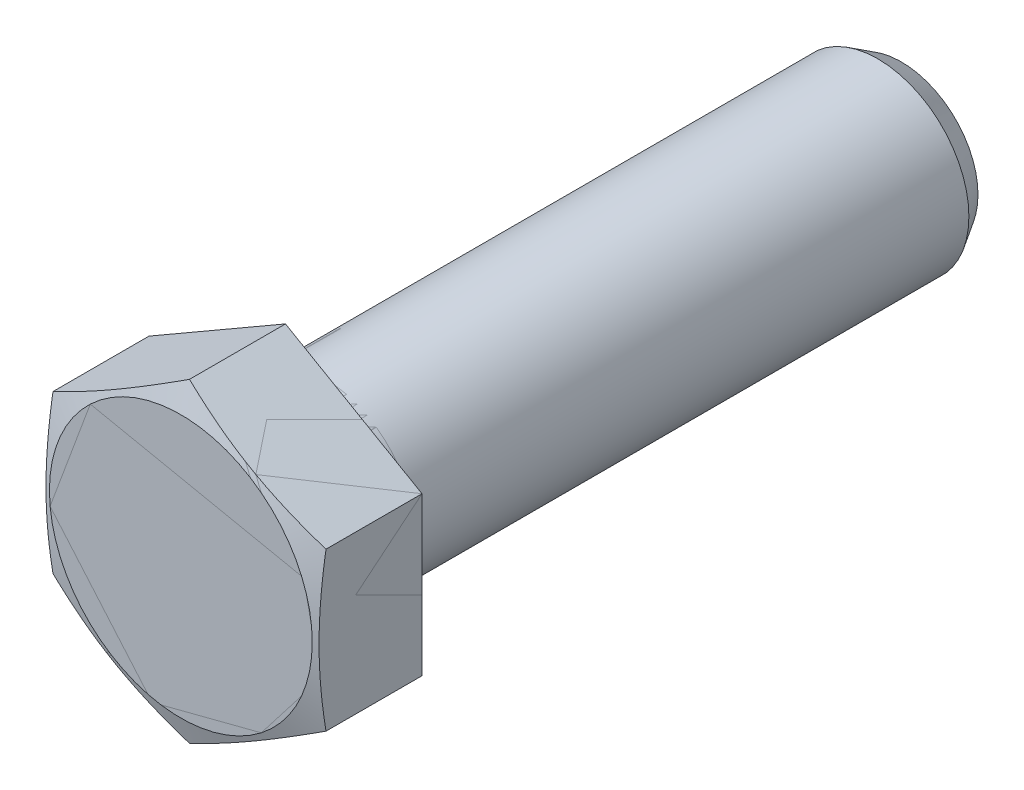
ISO-10303-21;
HEADER;
FILE_DESCRIPTION(('STEP AP214'),'2;1');
FILE_NAME('part.step','',(''),(''),'','','');
FILE_SCHEMA(('AUTOMOTIVE_DESIGN { 1 0 10303 214 1 1 1 1 }'));
ENDSEC;
DATA;
#1=APPLICATION_CONTEXT('core data for automotive mechanical design processes');
#2=APPLICATION_PROTOCOL_DEFINITION('international standard','automotive_design',2000,#1);
#3=PRODUCT_CONTEXT('',#1,'mechanical');
#4=PRODUCT('Part','Part','',(#3));
#5=PRODUCT_RELATED_PRODUCT_CATEGORY('part','',(#4));
#6=PRODUCT_DEFINITION_FORMATION('','',#4);
#7=PRODUCT_DEFINITION_CONTEXT('part definition',#1,'design');
#8=PRODUCT_DEFINITION('design','',#6,#7);
#9=PRODUCT_DEFINITION_SHAPE('','',#8);
#10=(LENGTH_UNIT() NAMED_UNIT(*) SI_UNIT(.MILLI.,.METRE.));
#11=(NAMED_UNIT(*) PLANE_ANGLE_UNIT() SI_UNIT($,.RADIAN.));
#12=(NAMED_UNIT(*) SI_UNIT($,.STERADIAN.) SOLID_ANGLE_UNIT());
#13=UNCERTAINTY_MEASURE_WITH_UNIT(LENGTH_MEASURE(1.E-05),#10,'distance_accuracy_value','');
#14=(GEOMETRIC_REPRESENTATION_CONTEXT(3) GLOBAL_UNCERTAINTY_ASSIGNED_CONTEXT((#13)) GLOBAL_UNIT_ASSIGNED_CONTEXT((#10,
#11,#12)) REPRESENTATION_CONTEXT('',''));
#15=CARTESIAN_POINT('',(0.,0.,0.));
#16=DIRECTION('',(0.,0.,1.));
#17=DIRECTION('',(1.,0.,0.));
#18=AXIS2_PLACEMENT_3D('',#15,#16,#17);
#19=CARTESIAN_POINT('',(0.,0.,0.6));
#20=DIRECTION('',(0.,0.,1.));
#21=DIRECTION('',(1.,0.,0.));
#22=AXIS2_PLACEMENT_3D('',#19,#20,#21);
#23=TOROIDAL_SURFACE('',#22,7.6,0.6);
#24=CARTESIAN_POINT('',(0.,0.,0.6));
#25=DIRECTION('',(0.,0.,1.));
#26=DIRECTION('',(1.,0.,0.));
#27=AXIS2_PLACEMENT_3D('',#24,#25,#26);
#28=CIRCLE('',#27,8.2);
#29=CARTESIAN_POINT('',(8.2,0.,0.600000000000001));
#30=VERTEX_POINT('',#29);
#31=EDGE_CURVE('P0_E11',#30,#30,#28,.T.);
#32=ORIENTED_EDGE('',*,*,#31,.F.);
#33=EDGE_LOOP('',(#32));
#34=FACE_BOUND('',#33,.T.);
#35=CARTESIAN_POINT('',(0.,0.,0.));
#36=DIRECTION('',(0.,0.,1.));
#37=DIRECTION('',(1.,0.,0.));
#38=AXIS2_PLACEMENT_3D('',#35,#36,#37);
#39=CIRCLE('',#38,7.6);
#40=CARTESIAN_POINT('',(7.6,0.,0.));
#41=VERTEX_POINT('',#40);
#42=EDGE_CURVE('P0_E33',#41,#41,#39,.T.);
#43=ORIENTED_EDGE('',*,*,#42,.T.);
#44=EDGE_LOOP('',(#43));
#45=FACE_BOUND('',#44,.T.);
#46=ADVANCED_FACE('P0_F26',(#34,#45),#23,.T.);
#47=CARTESIAN_POINT('',(0.,7.6,0.));
#48=DIRECTION('',(0.,0.,-1.));
#49=DIRECTION('',(-1.,0.,0.));
#50=AXIS2_PLACEMENT_3D('',#47,#48,#49);
#51=PLANE('',#50);
#52=CARTESIAN_POINT('',(0.,0.,0.));
#53=DIRECTION('',(0.,0.,1.));
#54=DIRECTION('',(1.,0.,0.));
#55=AXIS2_PLACEMENT_3D('',#52,#53,#54);
#56=CIRCLE('',#55,6.6);
#57=CARTESIAN_POINT('',(6.6,0.,0.));
#58=VERTEX_POINT('',#57);
#59=EDGE_CURVE('P0_E118',#58,#58,#56,.T.);
#60=ORIENTED_EDGE('',*,*,#59,.T.);
#61=EDGE_LOOP('',(#60));
#62=FACE_BOUND('',#61,.T.);
#63=ORIENTED_EDGE('',*,*,#42,.F.);
#64=EDGE_LOOP('',(#63));
#65=FACE_BOUND('',#64,.T.);
#66=ADVANCED_FACE('P0_F124',(#62,#65),#51,.T.);
#67=CARTESIAN_POINT('',(0.,0.,-0.6));
#68=DIRECTION('',(0.,0.,1.));
#69=DIRECTION('',(1.,0.,0.));
#70=AXIS2_PLACEMENT_3D('',#67,#68,#69);
#71=TOROIDAL_SURFACE('',#70,6.6,0.6);
#72=CARTESIAN_POINT('',(0.,0.,-0.6));
#73=DIRECTION('',(0.,0.,1.));
#74=DIRECTION('',(1.,0.,0.));
#75=AXIS2_PLACEMENT_3D('',#72,#73,#74);
#76=CIRCLE('',#75,6.);
#77=CARTESIAN_POINT('',(6.,0.,-0.6));
#78=VERTEX_POINT('',#77);
#79=EDGE_CURVE('P0_E115',#78,#78,#76,.T.);
#80=ORIENTED_EDGE('',*,*,#79,.T.);
#81=EDGE_LOOP('',(#80));
#82=FACE_BOUND('',#81,.T.);
#83=ORIENTED_EDGE('',*,*,#59,.F.);
#84=EDGE_LOOP('',(#83));
#85=FACE_BOUND('',#84,.T.);
#86=ADVANCED_FACE('P0_F126',(#82,#85),#71,.F.);
#87=CARTESIAN_POINT('',(-9.,-5.19615,0.6));
#88=DIRECTION('',(0.,0.,-1.));
#89=DIRECTION('',(-1.,0.,0.));
#90=AXIS2_PLACEMENT_3D('',#87,#88,#89);
#91=PLANE('',#90);
#92=DIRECTION('',(0.,-1.,0.));
#93=VECTOR('',#92,1.);
#94=CARTESIAN_POINT('',(-9.,5.19615,0.6));
#95=LINE('',#94,#93);
#96=CARTESIAN_POINT('',(-9.,5.19615,0.6));
#97=VERTEX_POINT('',#96);
#98=CARTESIAN_POINT('',(-9.,-5.19615,0.6));
#99=VERTEX_POINT('',#98);
#100=EDGE_CURVE('P0_E92',#97,#99,#95,.T.);
#101=ORIENTED_EDGE('',*,*,#100,.F.);
#102=DIRECTION('',(0.866025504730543,0.499999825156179,0.));
#103=VECTOR('',#102,1.);
#104=CARTESIAN_POINT('',(-9.,5.19615,0.6));
#105=LINE('',#104,#103);
#106=CARTESIAN_POINT('',(0.,10.3923,0.6));
#107=VERTEX_POINT('',#106);
#108=EDGE_CURVE('P0_E97',#97,#107,#105,.T.);
#109=ORIENTED_EDGE('',*,*,#108,.T.);
#110=DIRECTION('',(0.866025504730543,-0.499999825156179,0.));
#111=VECTOR('',#110,1.);
#112=CARTESIAN_POINT('',(0.,10.3923,0.6));
#113=LINE('',#112,#111);
#114=CARTESIAN_POINT('',(9.,5.19615,0.6));
#115=VERTEX_POINT('',#114);
#116=EDGE_CURVE('P0_E103',#107,#115,#113,.T.);
#117=ORIENTED_EDGE('',*,*,#116,.T.);
#118=DIRECTION('',(0.,-1.,0.));
#119=VECTOR('',#118,1.);
#120=CARTESIAN_POINT('',(9.,5.19615,0.6));
#121=LINE('',#120,#119);
#122=CARTESIAN_POINT('',(9.,-5.19615,0.6));
#123=VERTEX_POINT('',#122);
#124=EDGE_CURVE('P0_E233',#115,#123,#121,.T.);
#125=ORIENTED_EDGE('',*,*,#124,.T.);
#126=DIRECTION('',(-0.866025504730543,-0.499999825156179,0.));
#127=VECTOR('',#126,1.);
#128=CARTESIAN_POINT('',(9.,-5.19615,0.6));
#129=LINE('',#128,#127);
#130=CARTESIAN_POINT('',(0.,-10.3923,0.6));
#131=VERTEX_POINT('',#130);
#132=EDGE_CURVE('P0_E219',#123,#131,#129,.T.);
#133=ORIENTED_EDGE('',*,*,#132,.T.);
#134=DIRECTION('',(-0.866025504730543,0.499999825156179,0.));
#135=VECTOR('',#134,1.);
#136=CARTESIAN_POINT('',(0.,-10.3923,0.6));
#137=LINE('',#136,#135);
#138=EDGE_CURVE('P0_E217',#131,#99,#137,.T.);
#139=ORIENTED_EDGE('',*,*,#138,.T.);
#140=EDGE_LOOP('',(#101,#109,#117,#125,#133,#139));
#141=FACE_BOUND('',#140,.T.);
#142=ORIENTED_EDGE('',*,*,#31,.T.);
#143=EDGE_LOOP('',(#142));
#144=FACE_BOUND('',#143,.T.);
#145=ADVANCED_FACE('P0_F132',(#141,#144),#91,.T.);
#146=CARTESIAN_POINT('',(-9.,5.19615,0.6));
#147=DIRECTION('',(-1.,0.,0.));
#148=DIRECTION('',(0.,0.,1.));
#149=AXIS2_PLACEMENT_3D('',#146,#147,#148);
#150=PLANE('',#149);
#151=CARTESIAN_POINT('',(-9.,-13.7470885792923,4.93453459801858));
#152=CARTESIAN_POINT('',(-9.,-13.3392874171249,5.04718491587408));
#153=CARTESIAN_POINT('',(-9.,-12.9311091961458,5.15849505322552));
#154=CARTESIAN_POINT('',(-9.,-12.1138094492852,5.37769955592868));
#155=CARTESIAN_POINT('',(-9.,-11.7046878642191,5.48559370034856));
#156=CARTESIAN_POINT('',(-9.,-10.8847498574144,5.69737490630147));
#157=CARTESIAN_POINT('',(-9.,-10.4739318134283,5.80125570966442));
#158=CARTESIAN_POINT('',(-9.,-9.65101983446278,6.00383051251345));
#159=CARTESIAN_POINT('',(-9.,-9.23892591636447,6.10252458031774));
#160=CARTESIAN_POINT('',(-9.,-8.41811436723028,6.29233104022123));
#161=CARTESIAN_POINT('',(-9.,-8.0094143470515,6.38351921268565));
#162=CARTESIAN_POINT('',(-9.,-7.19032773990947,6.55804869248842));
#163=CARTESIAN_POINT('',(-9.,-6.77994114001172,6.64138993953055));
#164=CARTESIAN_POINT('',(-9.,-5.95738209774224,6.79830951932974));
#165=CARTESIAN_POINT('',(-9.,-5.54521006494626,6.8718899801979));
#166=CARTESIAN_POINT('',(-9.,-4.71888494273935,7.00707177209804));
#167=CARTESIAN_POINT('',(-9.,-4.30473186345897,7.0686731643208));
#168=CARTESIAN_POINT('',(-9.,-3.48183307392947,7.17648586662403));
#169=CARTESIAN_POINT('',(-9.,-3.07312089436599,7.22294955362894));
#170=CARTESIAN_POINT('',(-9.,-2.2541675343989,7.29970130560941));
#171=CARTESIAN_POINT('',(-9.,-1.84392640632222,7.32998991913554));
#172=CARTESIAN_POINT('',(-9.,-1.0227798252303,7.37263456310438));
#173=CARTESIAN_POINT('',(-9.,-0.611875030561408,7.38500302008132));
#174=CARTESIAN_POINT('',(-9.,0.210073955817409,7.39106039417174));
#175=CARTESIAN_POINT('',(-9.,0.621118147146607,7.38474936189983));
#176=CARTESIAN_POINT('',(-9.,1.44463812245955,7.35377442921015));
#177=CARTESIAN_POINT('',(-9.,1.85711025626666,7.32901539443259));
#178=CARTESIAN_POINT('',(-9.,2.68067263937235,7.26253252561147));
#179=CARTESIAN_POINT('',(-9.,3.09176284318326,7.22080813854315));
#180=CARTESIAN_POINT('',(-9.,3.91254232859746,7.12251563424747));
#181=CARTESIAN_POINT('',(-9.,4.32222985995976,7.0659331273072));
#182=CARTESIAN_POINT('',(-9.,5.13967057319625,6.94032062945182));
#183=CARTESIAN_POINT('',(-9.,5.54742374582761,6.87129057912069));
#184=CARTESIAN_POINT('',(-9.,6.34392226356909,6.72614777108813));
#185=CARTESIAN_POINT('',(-9.,6.73274502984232,6.65045563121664));
#186=CARTESIAN_POINT('',(-9.,7.50883064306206,6.49141952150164));
#187=CARTESIAN_POINT('',(-9.,7.89609341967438,6.40807521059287));
#188=CARTESIAN_POINT('',(-9.,8.66928474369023,6.2351536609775));
#189=CARTESIAN_POINT('',(-9.,9.05521306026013,6.14557539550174));
#190=CARTESIAN_POINT('',(-9.,9.82584964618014,5.96135982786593));
#191=CARTESIAN_POINT('',(-9.,10.2105579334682,5.86672260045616));
#192=CARTESIAN_POINT('',(-9.,10.9791002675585,5.67327627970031));
#193=CARTESIAN_POINT('',(-9.,11.3629338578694,5.57446537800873));
#194=CARTESIAN_POINT('',(-9.,12.1297113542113,5.37344471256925));
#195=CARTESIAN_POINT('',(-9.,12.5126552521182,5.27123491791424));
#196=CARTESIAN_POINT('',(-9.,13.6602702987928,4.96044653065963));
#197=CARTESIAN_POINT('',(-9.,14.4238088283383,4.74768748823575));
#198=CARTESIAN_POINT('',(-9.,15.9383314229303,4.31737090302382));
#199=CARTESIAN_POINT('',(-9.,16.689345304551,4.09991758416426));
#200=CARTESIAN_POINT('',(-9.,18.189792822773,3.65955502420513));
#201=CARTESIAN_POINT('',(-9.,18.9392264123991,3.43664562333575));
#202=CARTESIAN_POINT('',(-9.,20.4353823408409,2.98724599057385));
#203=CARTESIAN_POINT('',(-9.,21.1821071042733,2.76076381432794));
#204=CARTESIAN_POINT('',(-9.,22.3014752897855,2.41875920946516));
#205=CARTESIAN_POINT('',(-9.,22.674468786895,2.30438036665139));
#206=CARTESIAN_POINT('',(-9.,23.4202477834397,2.07494863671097));
#207=CARTESIAN_POINT('',(-9.,23.7930332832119,1.95989575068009));
#208=CARTESIAN_POINT('',(-9.,24.1657280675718,1.84454977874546));
#209=B_SPLINE_CURVE_WITH_KNOTS('',3,(#151,#152,#153,#154,#155,#156,#157,#158,#159,#160,#161,
#162,#163,#164,#165,#166,#167,#168,#169,#170,#171,#172,#173,#174,#175,#176,#177,#178,#179,#180,
#181,#182,#183,#184,#185,#186,#187,#188,#189,#190,#191,#192,#193,#194,#195,#196,#197,#198,#199,
#200,#201,#202,#203,#204,#205,#206,#207,#208),.UNSPECIFIED.,.F.,.F.,(4,2,2,2,2,2,2,2,2,2,2,2,2,
2,2,2,2,2,2,2,2,2,2,2,2,2,2,2,4),(0.,1.26923056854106,2.53854305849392,3.80976091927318,
5.08096203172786,6.33714874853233,7.59334511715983,8.84926714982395,10.1051827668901,
11.3389379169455,12.5726512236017,13.8055086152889,15.0383626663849,16.2776188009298,
17.5169153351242,18.7574165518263,19.9979236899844,21.1861971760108,22.3745236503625,
23.5630463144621,24.7515514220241,25.9405768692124,27.1296131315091,29.5074255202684,
31.8529867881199,34.1986168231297,36.5395543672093,37.7099640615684,38.8803718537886),.UNSPECIFIED.);
#210=CARTESIAN_POINT('',(-9.,5.19615,6.92894463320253));
#211=VERTEX_POINT('',#210);
#212=CARTESIAN_POINT('',(-9.,-5.19615,6.92894463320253));
#213=VERTEX_POINT('',#212);
#214=EDGE_CURVE('P0_E81',#211,#213,#209,.F.);
#215=ORIENTED_EDGE('',*,*,#214,.F.);
#216=DIRECTION('',(0.,0.,1.));
#217=VECTOR('',#216,1.);
#218=CARTESIAN_POINT('',(-9.,5.19615,0.6));
#219=LINE('',#218,#217);
#220=EDGE_CURVE('P0_E90',#97,#211,#219,.T.);
#221=ORIENTED_EDGE('',*,*,#220,.F.);
#222=ORIENTED_EDGE('',*,*,#100,.T.);
#223=DIRECTION('',(0.,0.,1.));
#224=VECTOR('',#223,1.);
#225=CARTESIAN_POINT('',(-9.,-5.19615,0.6));
#226=LINE('',#225,#224);
#227=EDGE_CURVE('P0_E48',#99,#213,#226,.T.);
#228=ORIENTED_EDGE('',*,*,#227,.T.);
#229=EDGE_LOOP('',(#215,#221,#222,#228));
#230=FACE_BOUND('',#229,.T.);
#231=ADVANCED_FACE('P0_F88',(#230),#150,.T.);
#232=CARTESIAN_POINT('',(0.,-10.3923,0.6));
#233=DIRECTION('',(0.499999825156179,0.866025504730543,0.));
#234=DIRECTION('',(0.866025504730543,-0.499999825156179,0.));
#235=AXIS2_PLACEMENT_3D('',#232,#233,#234);
#236=PLANE('',#235);
#237=DIRECTION('',(0.,0.,1.));
#238=VECTOR('',#237,1.);
#239=CARTESIAN_POINT('',(0.,-10.3923,0.6));
#240=LINE('',#239,#238);
#241=CARTESIAN_POINT('',(0.,-10.3923,6.92894583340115));
#242=VERTEX_POINT('',#241);
#243=EDGE_CURVE('P0_E224',#131,#242,#240,.T.);
#244=ORIENTED_EDGE('',*,*,#243,.T.);
#245=CARTESIAN_POINT('',(1.9999999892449E-07,-10.39230011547,6.92894579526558));
#246=CARTESIAN_POINT('',(-0.373107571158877,-10.1768863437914,7.00011400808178));
#247=CARTESIAN_POINT('',(-0.747233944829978,-9.96088448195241,7.06480339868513));
#248=CARTESIAN_POINT('',(-1.49749109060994,-9.52772351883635,7.17855326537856));
#249=CARTESIAN_POINT('',(-1.87362298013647,-9.31056377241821,7.22760383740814));
#250=CARTESIAN_POINT('',(-2.62444400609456,-8.87707725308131,7.30699688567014));
#251=CARTESIAN_POINT('',(-2.99912148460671,-8.66075721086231,7.33748241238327));
#252=CARTESIAN_POINT('',(-3.74919949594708,-8.22769967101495,7.37836755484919));
#253=CARTESIAN_POINT('',(-4.1245997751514,-8.01096231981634,7.38877325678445));
#254=CARTESIAN_POINT('',(-4.87540032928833,-7.57748761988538,7.38877313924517));
#255=CARTESIAN_POINT('',(-5.25080060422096,-7.36075027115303,7.37836731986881));
#256=CARTESIAN_POINT('',(-6.00087860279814,-6.9276927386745,7.33748195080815));
#257=CARTESIAN_POINT('',(-6.37555607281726,-6.71137270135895,7.30699631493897));
#258=CARTESIAN_POINT('',(-7.12637707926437,-6.27788619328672,7.22760306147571));
#259=CARTESIAN_POINT('',(-7.50250895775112,-6.06072645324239,7.17855239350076));
#260=CARTESIAN_POINT('',(-8.25276607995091,-5.62756550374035,7.06480235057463));
#261=CARTESIAN_POINT('',(-8.62689244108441,-5.41156364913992,7.00011287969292));
#262=CARTESIAN_POINT('',(-9.0000002,-5.19614988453,6.92894459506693));
#263=B_SPLINE_CURVE_WITH_KNOTS('',3,(#245,#246,#247,#248,#249,#250,#251,#252,#253,#254,#255,
#256,#257,#258,#259,#260,#261,#262),.UNSPECIFIED.,.F.,.F.,(4,2,2,2,2,2,2,2,4),(0.,
1.31010734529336,2.62104274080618,3.9217446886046,5.22205233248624,6.52235997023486,
7.82306191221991,9.13399730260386,10.4441046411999),.UNSPECIFIED.);
#264=EDGE_CURVE('P0_E93',#242,#213,#263,.T.);
#265=ORIENTED_EDGE('',*,*,#264,.T.);
#266=ORIENTED_EDGE('',*,*,#227,.F.);
#267=ORIENTED_EDGE('',*,*,#138,.F.);
#268=EDGE_LOOP('',(#244,#265,#266,#267));
#269=FACE_BOUND('',#268,.T.);
#270=ADVANCED_FACE('P0_F153',(#269),#236,.F.);
#271=CARTESIAN_POINT('',(9.,-5.19615,0.6));
#272=DIRECTION('',(-0.499999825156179,0.866025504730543,0.));
#273=DIRECTION('',(0.866025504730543,0.499999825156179,0.));
#274=AXIS2_PLACEMENT_3D('',#271,#272,#273);
#275=PLANE('',#274);
#276=DIRECTION('',(0.,0.,1.));
#277=VECTOR('',#276,1.);
#278=CARTESIAN_POINT('',(9.,-5.19615,0.6));
#279=LINE('',#278,#277);
#280=CARTESIAN_POINT('',(9.,-5.19615,6.92894463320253));
#281=VERTEX_POINT('',#280);
#282=EDGE_CURVE('P0_E227',#123,#281,#279,.T.);
#283=ORIENTED_EDGE('',*,*,#282,.T.);
#284=CARTESIAN_POINT('',(9.0000002,-5.19614988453,6.92894459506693));
#285=CARTESIAN_POINT('',(8.62689244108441,-5.41156364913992,7.00011287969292));
#286=CARTESIAN_POINT('',(8.25276607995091,-5.62756550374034,7.06480235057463));
#287=CARTESIAN_POINT('',(7.50250895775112,-6.06072645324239,7.17855239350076));
#288=CARTESIAN_POINT('',(7.12637707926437,-6.27788619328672,7.22760306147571));
#289=CARTESIAN_POINT('',(6.37555607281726,-6.71137270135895,7.30699631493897));
#290=CARTESIAN_POINT('',(6.00087860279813,-6.9276927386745,7.33748195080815));
#291=CARTESIAN_POINT('',(5.25080060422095,-7.36075027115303,7.37836731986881));
#292=CARTESIAN_POINT('',(4.87540032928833,-7.57748761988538,7.38877313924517));
#293=CARTESIAN_POINT('',(4.12459977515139,-8.01096231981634,7.38877325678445));
#294=CARTESIAN_POINT('',(3.74919949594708,-8.22769967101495,7.3783675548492));
#295=CARTESIAN_POINT('',(2.99912148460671,-8.66075721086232,7.33748241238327));
#296=CARTESIAN_POINT('',(2.62444400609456,-8.87707725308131,7.30699688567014));
#297=CARTESIAN_POINT('',(1.87362298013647,-9.31056377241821,7.22760383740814));
#298=CARTESIAN_POINT('',(1.49749109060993,-9.52772351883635,7.17855326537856));
#299=CARTESIAN_POINT('',(0.747233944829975,-9.96088448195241,7.06480339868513));
#300=CARTESIAN_POINT('',(0.373107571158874,-10.1768863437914,7.00011400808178));
#301=CARTESIAN_POINT('',(-2.00000003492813E-07,-10.39230011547,6.92894579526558));
#302=B_SPLINE_CURVE_WITH_KNOTS('',3,(#284,#285,#286,#287,#288,#289,#290,#291,#292,#293,#294,
#295,#296,#297,#298,#299,#300,#301),.UNSPECIFIED.,.F.,.F.,(4,2,2,2,2,2,2,2,4),(0.,
1.31010733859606,2.62104272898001,3.92174467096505,5.22205230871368,6.52235995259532,
7.82306190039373,9.13399729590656,10.4441046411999),.UNSPECIFIED.);
#303=EDGE_CURVE('P0_E190',#281,#242,#302,.T.);
#304=ORIENTED_EDGE('',*,*,#303,.T.);
#305=ORIENTED_EDGE('',*,*,#243,.F.);
#306=ORIENTED_EDGE('',*,*,#132,.F.);
#307=EDGE_LOOP('',(#283,#304,#305,#306));
#308=FACE_BOUND('',#307,.T.);
#309=ADVANCED_FACE('P0_F195',(#308),#275,.F.);
#310=CARTESIAN_POINT('',(9.,5.19615,0.6));
#311=DIRECTION('',(-1.,0.,0.));
#312=DIRECTION('',(0.,0.,1.));
#313=AXIS2_PLACEMENT_3D('',#310,#311,#312);
#314=PLANE('',#313);
#315=DIRECTION('',(0.,0.,1.));
#316=VECTOR('',#315,1.);
#317=CARTESIAN_POINT('',(9.,5.19615,0.6));
#318=LINE('',#317,#316);
#319=CARTESIAN_POINT('',(9.,5.19615,6.92894463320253));
#320=VERTEX_POINT('',#319);
#321=EDGE_CURVE('P0_E101',#115,#320,#318,.T.);
#322=ORIENTED_EDGE('',*,*,#321,.T.);
#323=CARTESIAN_POINT('',(9.,-13.7470885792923,4.93453459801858));
#324=CARTESIAN_POINT('',(9.,-13.3392874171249,5.04718491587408));
#325=CARTESIAN_POINT('',(9.,-12.9311091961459,5.15849505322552));
#326=CARTESIAN_POINT('',(9.,-12.1138094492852,5.37769955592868));
#327=CARTESIAN_POINT('',(9.,-11.7046878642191,5.48559370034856));
#328=CARTESIAN_POINT('',(9.,-10.8847498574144,5.69737490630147));
#329=CARTESIAN_POINT('',(9.,-10.4739318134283,5.80125570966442));
#330=CARTESIAN_POINT('',(9.,-9.65101983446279,6.00383051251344));
#331=CARTESIAN_POINT('',(9.,-9.23892591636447,6.10252458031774));
#332=CARTESIAN_POINT('',(9.,-8.41811436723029,6.29233104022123));
#333=CARTESIAN_POINT('',(9.,-8.00941434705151,6.38351921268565));
#334=CARTESIAN_POINT('',(9.,-7.19032773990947,6.55804869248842));
#335=CARTESIAN_POINT('',(9.,-6.77994114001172,6.64138993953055));
#336=CARTESIAN_POINT('',(9.,-5.95738209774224,6.79830951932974));
#337=CARTESIAN_POINT('',(9.,-5.54521006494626,6.8718899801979));
#338=CARTESIAN_POINT('',(9.,-4.71888494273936,7.00707177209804));
#339=CARTESIAN_POINT('',(9.,-4.30473186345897,7.0686731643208));
#340=CARTESIAN_POINT('',(9.,-3.48183307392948,7.17648586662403));
#341=CARTESIAN_POINT('',(9.,-3.073120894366,7.22294955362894));
#342=CARTESIAN_POINT('',(9.,-2.25416753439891,7.29970130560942));
#343=CARTESIAN_POINT('',(9.,-1.84392640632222,7.32998991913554));
#344=CARTESIAN_POINT('',(9.,-1.0227798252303,7.37263456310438));
#345=CARTESIAN_POINT('',(9.,-0.611875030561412,7.38500302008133));
#346=CARTESIAN_POINT('',(9.,0.210073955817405,7.39106039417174));
#347=CARTESIAN_POINT('',(9.,0.621118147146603,7.38474936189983));
#348=CARTESIAN_POINT('',(9.,1.44463812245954,7.35377442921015));
#349=CARTESIAN_POINT('',(9.,1.85711025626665,7.32901539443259));
#350=CARTESIAN_POINT('',(9.,2.68067263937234,7.26253252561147));
#351=CARTESIAN_POINT('',(9.,3.09176284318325,7.22080813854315));
#352=CARTESIAN_POINT('',(9.,3.91254232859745,7.12251563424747));
#353=CARTESIAN_POINT('',(9.,4.32222985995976,7.06593312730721));
#354=CARTESIAN_POINT('',(9.,5.13967057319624,6.94032062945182));
#355=CARTESIAN_POINT('',(9.,5.5474237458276,6.87129057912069));
#356=CARTESIAN_POINT('',(9.,6.34392226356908,6.72614777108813));
#357=CARTESIAN_POINT('',(9.,6.73274502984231,6.65045563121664));
#358=CARTESIAN_POINT('',(9.,7.50883064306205,6.49141952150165));
#359=CARTESIAN_POINT('',(9.,7.89609341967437,6.40807521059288));
#360=CARTESIAN_POINT('',(9.,8.66928474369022,6.2351536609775));
#361=CARTESIAN_POINT('',(9.,9.05521306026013,6.14557539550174));
#362=CARTESIAN_POINT('',(9.,9.82584964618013,5.96135982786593));
#363=CARTESIAN_POINT('',(9.,10.2105579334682,5.86672260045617));
#364=CARTESIAN_POINT('',(9.,10.9791002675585,5.67327627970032));
#365=CARTESIAN_POINT('',(9.,11.3629338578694,5.57446537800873));
#366=CARTESIAN_POINT('',(9.,12.1297113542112,5.37344471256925));
#367=CARTESIAN_POINT('',(9.,12.5126552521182,5.27123491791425));
#368=CARTESIAN_POINT('',(9.,13.6602702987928,4.96044653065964));
#369=CARTESIAN_POINT('',(9.,14.4238088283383,4.74768748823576));
#370=CARTESIAN_POINT('',(9.,15.9383314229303,4.31737090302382));
#371=CARTESIAN_POINT('',(9.,16.689345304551,4.09991758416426));
#372=CARTESIAN_POINT('',(9.,18.189792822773,3.65955502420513));
#373=CARTESIAN_POINT('',(9.,18.9392264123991,3.43664562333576));
#374=CARTESIAN_POINT('',(9.,20.4353823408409,2.98724599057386));
#375=CARTESIAN_POINT('',(9.,21.1821071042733,2.76076381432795));
#376=CARTESIAN_POINT('',(9.,22.3014752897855,2.41875920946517));
#377=CARTESIAN_POINT('',(9.,22.674468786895,2.30438036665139));
#378=CARTESIAN_POINT('',(9.,23.4202477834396,2.07494863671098));
#379=CARTESIAN_POINT('',(9.,23.7930332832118,1.95989575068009));
#380=CARTESIAN_POINT('',(9.,24.1657280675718,1.84454977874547));
#381=B_SPLINE_CURVE_WITH_KNOTS('',3,(#323,#324,#325,#326,#327,#328,#329,#330,#331,#332,#333,
#334,#335,#336,#337,#338,#339,#340,#341,#342,#343,#344,#345,#346,#347,#348,#349,#350,#351,#352,
#353,#354,#355,#356,#357,#358,#359,#360,#361,#362,#363,#364,#365,#366,#367,#368,#369,#370,#371,
#372,#373,#374,#375,#376,#377,#378,#379,#380),.UNSPECIFIED.,.F.,.F.,(4,2,2,2,2,2,2,2,2,2,2,2,2,
2,2,2,2,2,2,2,2,2,2,2,2,2,2,2,4),(0.,1.26923056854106,2.53854305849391,3.80976091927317,
5.08096203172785,6.33714874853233,7.59334511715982,8.84926714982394,10.1051827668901,
11.3389379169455,12.5726512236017,13.8055086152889,15.0383626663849,16.2776188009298,
17.5169153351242,18.7574165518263,19.9979236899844,21.1861971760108,22.3745236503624,
23.5630463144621,24.751551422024,25.9405768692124,27.1296131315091,29.5074255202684,
31.8529867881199,34.1986168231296,36.5395543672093,37.7099640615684,38.8803718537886),.UNSPECIFIED.);
#382=EDGE_CURVE('P0_E185',#320,#281,#381,.F.);
#383=ORIENTED_EDGE('',*,*,#382,.T.);
#384=ORIENTED_EDGE('',*,*,#282,.F.);
#385=ORIENTED_EDGE('',*,*,#124,.F.);
#386=EDGE_LOOP('',(#322,#383,#384,#385));
#387=FACE_BOUND('',#386,.T.);
#388=ADVANCED_FACE('P0_F198',(#387),#314,.F.);
#389=CARTESIAN_POINT('',(0.,10.3923,0.6));
#390=DIRECTION('',(-0.499999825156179,-0.866025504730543,0.));
#391=DIRECTION('',(-0.866025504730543,0.499999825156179,0.));
#392=AXIS2_PLACEMENT_3D('',#389,#390,#391);
#393=PLANE('',#392);
#394=DIRECTION('',(0.,0.,1.));
#395=VECTOR('',#394,1.);
#396=CARTESIAN_POINT('',(0.,10.3923,0.6));
#397=LINE('',#396,#395);
#398=CARTESIAN_POINT('',(0.,10.3923,6.92894583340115));
#399=VERTEX_POINT('',#398);
#400=EDGE_CURVE('P0_E99',#107,#399,#397,.T.);
#401=ORIENTED_EDGE('',*,*,#400,.T.);
#402=CARTESIAN_POINT('',(-1.99999998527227E-07,10.39230011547,6.92894579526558));
#403=CARTESIAN_POINT('',(0.373107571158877,10.1768863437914,7.00011400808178));
#404=CARTESIAN_POINT('',(0.747233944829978,9.96088448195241,7.06480339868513));
#405=CARTESIAN_POINT('',(1.49749109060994,9.52772351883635,7.17855326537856));
#406=CARTESIAN_POINT('',(1.87362298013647,9.31056377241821,7.22760383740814));
#407=CARTESIAN_POINT('',(2.62444400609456,8.87707725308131,7.30699688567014));
#408=CARTESIAN_POINT('',(2.99912148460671,8.66075721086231,7.33748241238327));
#409=CARTESIAN_POINT('',(3.74919949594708,8.22769967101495,7.37836755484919));
#410=CARTESIAN_POINT('',(4.1245997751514,8.01096231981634,7.38877325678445));
#411=CARTESIAN_POINT('',(4.87540032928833,7.57748761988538,7.38877313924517));
#412=CARTESIAN_POINT('',(5.25080060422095,7.36075027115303,7.37836731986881));
#413=CARTESIAN_POINT('',(6.00087860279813,6.9276927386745,7.33748195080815));
#414=CARTESIAN_POINT('',(6.37555607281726,6.71137270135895,7.30699631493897));
#415=CARTESIAN_POINT('',(7.12637707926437,6.27788619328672,7.22760306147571));
#416=CARTESIAN_POINT('',(7.50250895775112,6.06072645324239,7.17855239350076));
#417=CARTESIAN_POINT('',(8.25276607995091,5.62756550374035,7.06480235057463));
#418=CARTESIAN_POINT('',(8.62689244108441,5.41156364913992,7.00011287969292));
#419=CARTESIAN_POINT('',(9.0000002,5.19614988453,6.92894459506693));
#420=B_SPLINE_CURVE_WITH_KNOTS('',3,(#402,#403,#404,#405,#406,#407,#408,#409,#410,#411,#412,
#413,#414,#415,#416,#417,#418,#419),.UNSPECIFIED.,.F.,.F.,(4,2,2,2,2,2,2,2,4),(0.,
1.31010734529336,2.62104274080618,3.9217446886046,5.22205233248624,6.52235997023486,
7.82306191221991,9.13399730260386,10.4441046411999),.UNSPECIFIED.);
#421=EDGE_CURVE('P0_E40',#399,#320,#420,.T.);
#422=ORIENTED_EDGE('',*,*,#421,.T.);
#423=ORIENTED_EDGE('',*,*,#321,.F.);
#424=ORIENTED_EDGE('',*,*,#116,.F.);
#425=EDGE_LOOP('',(#401,#422,#423,#424));
#426=FACE_BOUND('',#425,.T.);
#427=ADVANCED_FACE('P0_F202',(#426),#393,.F.);
#428=CARTESIAN_POINT('',(-9.,5.19615,0.6));
#429=DIRECTION('',(0.499999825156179,-0.866025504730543,0.));
#430=DIRECTION('',(-0.866025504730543,-0.499999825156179,0.));
#431=AXIS2_PLACEMENT_3D('',#428,#429,#430);
#432=PLANE('',#431);
#433=ORIENTED_EDGE('',*,*,#220,.T.);
#434=CARTESIAN_POINT('',(-9.0000002,5.19614988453,6.92894459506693));
#435=CARTESIAN_POINT('',(-8.62689244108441,5.41156364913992,7.00011287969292));
#436=CARTESIAN_POINT('',(-8.25276607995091,5.62756550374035,7.06480235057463));
#437=CARTESIAN_POINT('',(-7.50250895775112,6.06072645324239,7.17855239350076));
#438=CARTESIAN_POINT('',(-7.12637707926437,6.27788619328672,7.22760306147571));
#439=CARTESIAN_POINT('',(-6.37555607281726,6.71137270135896,7.30699631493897));
#440=CARTESIAN_POINT('',(-6.00087860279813,6.9276927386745,7.33748195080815));
#441=CARTESIAN_POINT('',(-5.25080060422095,7.36075027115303,7.37836731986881));
#442=CARTESIAN_POINT('',(-4.87540032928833,7.57748761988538,7.38877313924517));
#443=CARTESIAN_POINT('',(-4.12459977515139,8.01096231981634,7.38877325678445));
#444=CARTESIAN_POINT('',(-3.74919949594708,8.22769967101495,7.37836755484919));
#445=CARTESIAN_POINT('',(-2.99912148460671,8.66075721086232,7.33748241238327));
#446=CARTESIAN_POINT('',(-2.62444400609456,8.87707725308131,7.30699688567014));
#447=CARTESIAN_POINT('',(-1.87362298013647,9.31056377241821,7.22760383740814));
#448=CARTESIAN_POINT('',(-1.49749109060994,9.52772351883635,7.17855326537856));
#449=CARTESIAN_POINT('',(-0.747233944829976,9.96088448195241,7.06480339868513));
#450=CARTESIAN_POINT('',(-0.373107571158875,10.1768863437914,7.00011400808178));
#451=CARTESIAN_POINT('',(2.00000002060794E-07,10.39230011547,6.92894579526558));
#452=B_SPLINE_CURVE_WITH_KNOTS('',3,(#434,#435,#436,#437,#438,#439,#440,#441,#442,#443,#444,
#445,#446,#447,#448,#449,#450,#451),.UNSPECIFIED.,.F.,.F.,(4,2,2,2,2,2,2,2,4),(0.,
1.31010733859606,2.62104272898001,3.92174467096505,5.22205230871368,6.52235995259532,
7.82306190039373,9.13399729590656,10.4441046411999),.UNSPECIFIED.);
#453=EDGE_CURVE('P0_E77',#211,#399,#452,.T.);
#454=ORIENTED_EDGE('',*,*,#453,.T.);
#455=ORIENTED_EDGE('',*,*,#400,.F.);
#456=ORIENTED_EDGE('',*,*,#108,.F.);
#457=EDGE_LOOP('',(#433,#454,#455,#456));
#458=FACE_BOUND('',#457,.T.);
#459=ADVANCED_FACE('P0_F95',(#458),#432,.F.);
#460=CARTESIAN_POINT('',(0.,0.,6.86030181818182));
#461=DIRECTION('',(0.,0.,-1.));
#462=DIRECTION('',(-1.,0.,0.));
#463=AXIS2_PLACEMENT_3D('',#460,#461,#462);
#464=CONICAL_SURFACE('',#463,10.600146,1.25181086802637);
#465=ORIENTED_EDGE('',*,*,#214,.T.);
#466=ORIENTED_EDGE('',*,*,#264,.F.);
#467=ORIENTED_EDGE('',*,*,#303,.F.);
#468=ORIENTED_EDGE('',*,*,#382,.F.);
#469=ORIENTED_EDGE('',*,*,#421,.F.);
#470=ORIENTED_EDGE('',*,*,#453,.F.);
#471=EDGE_LOOP('',(#465,#466,#467,#468,#469,#470));
#472=FACE_BOUND('',#471,.T.);
#473=CARTESIAN_POINT('',(0.,0.,7.5));
#474=DIRECTION('',(0.,0.,-1.));
#475=DIRECTION('',(-1.,0.,0.));
#476=AXIS2_PLACEMENT_3D('',#473,#474,#475);
#477=CIRCLE('',#476,8.66321518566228);
#478=CARTESIAN_POINT('',(-8.66321518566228,0.,7.5));
#479=VERTEX_POINT('',#478);
#480=EDGE_CURVE('P0_E85',#479,#479,#477,.F.);
#481=ORIENTED_EDGE('',*,*,#480,.F.);
#482=EDGE_LOOP('',(#481));
#483=FACE_BOUND('',#482,.T.);
#484=ADVANCED_FACE('P0_F79',(#472,#483),#464,.T.);
#485=CARTESIAN_POINT('',(-9.,-5.19615,7.5));
#486=DIRECTION('',(0.,0.,-1.));
#487=DIRECTION('',(-1.,0.,0.));
#488=AXIS2_PLACEMENT_3D('',#485,#486,#487);
#489=PLANE('',#488);
#490=ORIENTED_EDGE('',*,*,#480,.T.);
#491=EDGE_LOOP('',(#490));
#492=FACE_BOUND('',#491,.T.);
#493=ADVANCED_FACE('P0_F148',(#492),#489,.F.);
#494=CARTESIAN_POINT('',(0.,5.0528125,-40.));
#495=DIRECTION('',(0.,0.,-1.));
#496=DIRECTION('',(-1.,0.,0.));
#497=AXIS2_PLACEMENT_3D('',#494,#495,#496);
#498=PLANE('',#497);
#499=CARTESIAN_POINT('',(0.,0.,-40.));
#500=DIRECTION('',(0.,0.,1.));
#501=DIRECTION('',(1.,0.,0.));
#502=AXIS2_PLACEMENT_3D('',#499,#500,#501);
#503=CIRCLE('',#502,5.0528125);
#504=CARTESIAN_POINT('',(5.0528125,0.,-40.));
#505=VERTEX_POINT('',#504);
#506=EDGE_CURVE('P0_E109',#505,#505,#503,.T.);
#507=ORIENTED_EDGE('',*,*,#506,.F.);
#508=EDGE_LOOP('',(#507));
#509=FACE_BOUND('',#508,.T.);
#510=ADVANCED_FACE('P0_F144',(#509),#498,.T.);
#511=CARTESIAN_POINT('',(0.,0.,-38.4528125));
#512=DIRECTION('',(0.,0.,1.));
#513=DIRECTION('',(1.,0.,0.));
#514=AXIS2_PLACEMENT_3D('',#511,#512,#513);
#515=CONICAL_SURFACE('',#514,6.,0.549341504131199);
#516=ORIENTED_EDGE('',*,*,#506,.T.);
#517=EDGE_LOOP('',(#516));
#518=FACE_BOUND('',#517,.T.);
#519=CARTESIAN_POINT('',(0.,0.,-38.4528125));
#520=DIRECTION('',(0.,0.,1.));
#521=DIRECTION('',(1.,0.,0.));
#522=AXIS2_PLACEMENT_3D('',#519,#520,#521);
#523=CIRCLE('',#522,6.);
#524=CARTESIAN_POINT('',(6.,0.,-38.4528125));
#525=VERTEX_POINT('',#524);
#526=EDGE_CURVE('P0_E112',#525,#525,#523,.T.);
#527=ORIENTED_EDGE('',*,*,#526,.F.);
#528=EDGE_LOOP('',(#527));
#529=FACE_BOUND('',#528,.T.);
#530=ADVANCED_FACE('P0_F140',(#518,#529),#515,.T.);
#531=CARTESIAN_POINT('',(0.,0.,0.6));
#532=DIRECTION('',(0.,0.,1.));
#533=DIRECTION('',(1.,0.,0.));
#534=AXIS2_PLACEMENT_3D('',#531,#532,#533);
#535=CYLINDRICAL_SURFACE('',#534,6.);
#536=ORIENTED_EDGE('',*,*,#526,.T.);
#537=EDGE_LOOP('',(#536));
#538=FACE_BOUND('',#537,.T.);
#539=ORIENTED_EDGE('',*,*,#79,.F.);
#540=EDGE_LOOP('',(#539));
#541=FACE_BOUND('',#540,.T.);
#542=ADVANCED_FACE('P0_F137',(#538,#541),#535,.T.);
#543=CLOSED_SHELL('',(#46,#66,#86,#145,#231,#270,#309,#388,#427,#459,#484,#493,#510,#530,#542));
#544=MANIFOLD_SOLID_BREP('P0_B2',#543);
#545=CARTESIAN_POINT('',(0.,0.,0.6));
#546=DIRECTION('',(0.,0.,1.));
#547=DIRECTION('',(1.,0.,0.));
#548=AXIS2_PLACEMENT_3D('',#545,#546,#547);
#549=TOROIDAL_SURFACE('',#548,7.6,0.6);
#550=CARTESIAN_POINT('',(0.,0.,0.6));
#551=DIRECTION('',(0.,0.,1.));
#552=DIRECTION('',(1.,0.,0.));
#553=AXIS2_PLACEMENT_3D('',#550,#551,#552);
#554=CIRCLE('',#553,8.2);
#555=CARTESIAN_POINT('',(8.2,0.,0.600000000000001));
#556=VERTEX_POINT('',#555);
#557=EDGE_CURVE('P1_E11',#556,#556,#554,.T.);
#558=ORIENTED_EDGE('',*,*,#557,.F.);
#559=EDGE_LOOP('',(#558));
#560=FACE_BOUND('',#559,.T.);
#561=CARTESIAN_POINT('',(0.,0.,0.));
#562=DIRECTION('',(0.,0.,1.));
#563=DIRECTION('',(1.,0.,0.));
#564=AXIS2_PLACEMENT_3D('',#561,#562,#563);
#565=CIRCLE('',#564,7.6);
#566=CARTESIAN_POINT('',(7.6,0.,0.));
#567=VERTEX_POINT('',#566);
#568=EDGE_CURVE('P1_E23',#567,#567,#565,.T.);
#569=ORIENTED_EDGE('',*,*,#568,.T.);
#570=EDGE_LOOP('',(#569));
#571=FACE_BOUND('',#570,.T.);
#572=ADVANCED_FACE('P1_F16',(#560,#571),#549,.T.);
#573=CARTESIAN_POINT('',(0.,7.6,0.));
#574=DIRECTION('',(0.,0.,-1.));
#575=DIRECTION('',(-1.,0.,0.));
#576=AXIS2_PLACEMENT_3D('',#573,#574,#575);
#577=PLANE('',#576);
#578=CARTESIAN_POINT('',(0.,0.,0.));
#579=DIRECTION('',(0.,0.,1.));
#580=DIRECTION('',(1.,0.,0.));
#581=AXIS2_PLACEMENT_3D('',#578,#579,#580);
#582=CIRCLE('',#581,6.6);
#583=CARTESIAN_POINT('',(6.6,0.,0.));
#584=VERTEX_POINT('',#583);
#585=EDGE_CURVE('P1_E117',#584,#584,#582,.T.);
#586=ORIENTED_EDGE('',*,*,#585,.T.);
#587=EDGE_LOOP('',(#586));
#588=FACE_BOUND('',#587,.T.);
#589=ORIENTED_EDGE('',*,*,#568,.F.);
#590=EDGE_LOOP('',(#589));
#591=FACE_BOUND('',#590,.T.);
#592=ADVANCED_FACE('P1_F123',(#588,#591),#577,.T.);
#593=CARTESIAN_POINT('',(0.,0.,-0.6));
#594=DIRECTION('',(0.,0.,1.));
#595=DIRECTION('',(1.,0.,0.));
#596=AXIS2_PLACEMENT_3D('',#593,#594,#595);
#597=TOROIDAL_SURFACE('',#596,6.6,0.6);
#598=CARTESIAN_POINT('',(0.,0.,-0.6));
#599=DIRECTION('',(0.,0.,1.));
#600=DIRECTION('',(1.,0.,0.));
#601=AXIS2_PLACEMENT_3D('',#598,#599,#600);
#602=CIRCLE('',#601,6.);
#603=CARTESIAN_POINT('',(6.,0.,-0.6));
#604=VERTEX_POINT('',#603);
#605=EDGE_CURVE('P1_E114',#604,#604,#602,.T.);
#606=ORIENTED_EDGE('',*,*,#605,.T.);
#607=EDGE_LOOP('',(#606));
#608=FACE_BOUND('',#607,.T.);
#609=ORIENTED_EDGE('',*,*,#585,.F.);
#610=EDGE_LOOP('',(#609));
#611=FACE_BOUND('',#610,.T.);
#612=ADVANCED_FACE('P1_F125',(#608,#611),#597,.F.);
#613=CARTESIAN_POINT('',(0.,0.,0.6));
#614=DIRECTION('',(0.,0.,1.));
#615=DIRECTION('',(1.,0.,0.));
#616=AXIS2_PLACEMENT_3D('',#613,#614,#615);
#617=CYLINDRICAL_SURFACE('',#616,6.);
#618=CARTESIAN_POINT('',(0.,0.,-1.95942312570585));
#619=DIRECTION('',(0.,0.,1.));
#620=DIRECTION('',(1.,0.,0.));
#621=AXIS2_PLACEMENT_3D('',#618,#619,#620);
#622=CIRCLE('',#621,6.);
#623=CARTESIAN_POINT('',(6.,0.,-1.95942312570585));
#624=VERTEX_POINT('',#623);
#625=EDGE_CURVE('P1_E111',#624,#624,#622,.T.);
#626=ORIENTED_EDGE('',*,*,#625,.T.);
#627=EDGE_LOOP('',(#626));
#628=FACE_BOUND('',#627,.T.);
#629=ORIENTED_EDGE('',*,*,#605,.F.);
#630=EDGE_LOOP('',(#629));
#631=FACE_BOUND('',#630,.T.);
#632=ADVANCED_FACE('P1_F132',(#628,#631),#617,.T.);
#633=CARTESIAN_POINT('',(0.,0.,-1.95942312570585));
#634=DIRECTION('',(0.,0.,1.));
#635=DIRECTION('',(1.,0.,0.));
#636=AXIS2_PLACEMENT_3D('',#633,#634,#635);
#637=CONICAL_SURFACE('',#636,6.,0.523598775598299);
#638=CARTESIAN_POINT('',(0.,0.,-3.6));
#639=DIRECTION('',(0.,0.,1.));
#640=DIRECTION('',(1.,0.,0.));
#641=AXIS2_PLACEMENT_3D('',#638,#639,#640);
#642=CIRCLE('',#641,5.0528125);
#643=CARTESIAN_POINT('',(5.0528125,0.,-3.6));
#644=VERTEX_POINT('',#643);
#645=EDGE_CURVE('P1_E108',#644,#644,#642,.T.);
#646=ORIENTED_EDGE('',*,*,#645,.T.);
#647=EDGE_LOOP('',(#646));
#648=FACE_BOUND('',#647,.T.);
#649=ORIENTED_EDGE('',*,*,#625,.F.);
#650=EDGE_LOOP('',(#649));
#651=FACE_BOUND('',#650,.T.);
#652=ADVANCED_FACE('P1_F139',(#648,#651),#637,.T.);
#653=CARTESIAN_POINT('',(0.,5.0528125,-3.6));
#654=DIRECTION('',(0.,0.,1.));
#655=DIRECTION('',(1.,0.,0.));
#656=AXIS2_PLACEMENT_3D('',#653,#654,#655);
#657=PLANE('',#656);
#658=CARTESIAN_POINT('',(0.,0.,-3.6));
#659=DIRECTION('',(0.,0.,1.));
#660=DIRECTION('',(1.,0.,0.));
#661=AXIS2_PLACEMENT_3D('',#658,#659,#660);
#662=CIRCLE('',#661,6.);
#663=CARTESIAN_POINT('',(6.,0.,-3.6));
#664=VERTEX_POINT('',#663);
#665=EDGE_CURVE('P1_E105',#664,#664,#662,.T.);
#666=ORIENTED_EDGE('',*,*,#665,.T.);
#667=EDGE_LOOP('',(#666));
#668=FACE_BOUND('',#667,.T.);
#669=ORIENTED_EDGE('',*,*,#645,.F.);
#670=EDGE_LOOP('',(#669));
#671=FACE_BOUND('',#670,.T.);
#672=ADVANCED_FACE('P1_F143',(#668,#671),#657,.T.);
#673=CARTESIAN_POINT('',(0.,0.,0.6));
#674=DIRECTION('',(0.,0.,1.));
#675=DIRECTION('',(1.,0.,0.));
#676=AXIS2_PLACEMENT_3D('',#673,#674,#675);
#677=CYLINDRICAL_SURFACE('',#676,6.);
#678=CARTESIAN_POINT('',(0.,0.,-38.4528125));
#679=DIRECTION('',(0.,0.,1.));
#680=DIRECTION('',(1.,0.,0.));
#681=AXIS2_PLACEMENT_3D('',#678,#679,#680);
#682=CIRCLE('',#681,6.);
#683=CARTESIAN_POINT('',(6.,0.,-38.4528125));
#684=VERTEX_POINT('',#683);
#685=EDGE_CURVE('P1_E102',#684,#684,#682,.T.);
#686=ORIENTED_EDGE('',*,*,#685,.T.);
#687=EDGE_LOOP('',(#686));
#688=FACE_BOUND('',#687,.T.);
#689=ORIENTED_EDGE('',*,*,#665,.F.);
#690=EDGE_LOOP('',(#689));
#691=FACE_BOUND('',#690,.T.);
#692=ADVANCED_FACE('P1_F147',(#688,#691),#677,.T.);
#693=CARTESIAN_POINT('',(0.,0.,-38.4528125));
#694=DIRECTION('',(0.,0.,1.));
#695=DIRECTION('',(1.,0.,0.));
#696=AXIS2_PLACEMENT_3D('',#693,#694,#695);
#697=CONICAL_SURFACE('',#696,6.,0.549341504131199);
#698=CARTESIAN_POINT('',(0.,0.,-40.));
#699=DIRECTION('',(0.,0.,1.));
#700=DIRECTION('',(1.,0.,0.));
#701=AXIS2_PLACEMENT_3D('',#698,#699,#700);
#702=CIRCLE('',#701,5.0528125);
#703=CARTESIAN_POINT('',(5.0528125,0.,-40.));
#704=VERTEX_POINT('',#703);
#705=EDGE_CURVE('P1_E99',#704,#704,#702,.T.);
#706=ORIENTED_EDGE('',*,*,#705,.T.);
#707=EDGE_LOOP('',(#706));
#708=FACE_BOUND('',#707,.T.);
#709=ORIENTED_EDGE('',*,*,#685,.F.);
#710=EDGE_LOOP('',(#709));
#711=FACE_BOUND('',#710,.T.);
#712=ADVANCED_FACE('P1_F151',(#708,#711),#697,.T.);
#713=CARTESIAN_POINT('',(0.,5.0528125,-40.));
#714=DIRECTION('',(0.,0.,-1.));
#715=DIRECTION('',(-1.,0.,0.));
#716=AXIS2_PLACEMENT_3D('',#713,#714,#715);
#717=PLANE('',#716);
#718=ORIENTED_EDGE('',*,*,#705,.F.);
#719=EDGE_LOOP('',(#718));
#720=FACE_BOUND('',#719,.T.);
#721=ADVANCED_FACE('P1_F155',(#720),#717,.T.);
#722=CARTESIAN_POINT('',(-9.,-5.19615,0.6));
#723=DIRECTION('',(0.,0.,-1.));
#724=DIRECTION('',(-1.,0.,0.));
#725=AXIS2_PLACEMENT_3D('',#722,#723,#724);
#726=PLANE('',#725);
#727=DIRECTION('',(0.,-1.,0.));
#728=VECTOR('',#727,1.);
#729=CARTESIAN_POINT('',(-9.,5.19615,0.6));
#730=LINE('',#729,#728);
#731=CARTESIAN_POINT('',(-9.,5.19615,0.6));
#732=VERTEX_POINT('',#731);
#733=CARTESIAN_POINT('',(-9.,-5.19615,0.6));
#734=VERTEX_POINT('',#733);
#735=EDGE_CURVE('P1_E82',#732,#734,#730,.T.);
#736=ORIENTED_EDGE('',*,*,#735,.F.);
#737=DIRECTION('',(0.866025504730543,0.499999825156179,0.));
#738=VECTOR('',#737,1.);
#739=CARTESIAN_POINT('',(-9.,5.19615,0.6));
#740=LINE('',#739,#738);
#741=CARTESIAN_POINT('',(0.,10.3923,0.6));
#742=VERTEX_POINT('',#741);
#743=EDGE_CURVE('P1_E87',#732,#742,#740,.T.);
#744=ORIENTED_EDGE('',*,*,#743,.T.);
#745=DIRECTION('',(0.866025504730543,-0.499999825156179,0.));
#746=VECTOR('',#745,1.);
#747=CARTESIAN_POINT('',(0.,10.3923,0.6));
#748=LINE('',#747,#746);
#749=CARTESIAN_POINT('',(9.,5.19615,0.6));
#750=VERTEX_POINT('',#749);
#751=EDGE_CURVE('P1_E93',#742,#750,#748,.T.);
#752=ORIENTED_EDGE('',*,*,#751,.T.);
#753=DIRECTION('',(0.,-1.,0.));
#754=VECTOR('',#753,1.);
#755=CARTESIAN_POINT('',(9.,5.19615,0.6));
#756=LINE('',#755,#754);
#757=CARTESIAN_POINT('',(9.,-5.19615,0.6));
#758=VERTEX_POINT('',#757);
#759=EDGE_CURVE('P1_E245',#750,#758,#756,.T.);
#760=ORIENTED_EDGE('',*,*,#759,.T.);
#761=DIRECTION('',(-0.866025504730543,-0.499999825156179,0.));
#762=VECTOR('',#761,1.);
#763=CARTESIAN_POINT('',(9.,-5.19615,0.6));
#764=LINE('',#763,#762);
#765=CARTESIAN_POINT('',(0.,-10.3923,0.6));
#766=VERTEX_POINT('',#765);
#767=EDGE_CURVE('P1_E231',#758,#766,#764,.T.);
#768=ORIENTED_EDGE('',*,*,#767,.T.);
#769=DIRECTION('',(-0.866025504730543,0.499999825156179,0.));
#770=VECTOR('',#769,1.);
#771=CARTESIAN_POINT('',(0.,-10.3923,0.6));
#772=LINE('',#771,#770);
#773=EDGE_CURVE('P1_E229',#766,#734,#772,.T.);
#774=ORIENTED_EDGE('',*,*,#773,.T.);
#775=EDGE_LOOP('',(#736,#744,#752,#760,#768,#774));
#776=FACE_BOUND('',#775,.T.);
#777=ORIENTED_EDGE('',*,*,#557,.T.);
#778=EDGE_LOOP('',(#777));
#779=FACE_BOUND('',#778,.T.);
#780=ADVANCED_FACE('P1_F159',(#776,#779),#726,.T.);
#781=CARTESIAN_POINT('',(-9.,5.19615,0.6));
#782=DIRECTION('',(-1.,0.,0.));
#783=DIRECTION('',(0.,0.,1.));
#784=AXIS2_PLACEMENT_3D('',#781,#782,#783);
#785=PLANE('',#784);
#786=CARTESIAN_POINT('',(-9.,-13.7470885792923,4.93453459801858));
#787=CARTESIAN_POINT('',(-9.,-13.3392874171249,5.04718491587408));
#788=CARTESIAN_POINT('',(-9.,-12.9311091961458,5.15849505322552));
#789=CARTESIAN_POINT('',(-9.,-12.1138094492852,5.37769955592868));
#790=CARTESIAN_POINT('',(-9.,-11.7046878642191,5.48559370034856));
#791=CARTESIAN_POINT('',(-9.,-10.8847498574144,5.69737490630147));
#792=CARTESIAN_POINT('',(-9.,-10.4739318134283,5.80125570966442));
#793=CARTESIAN_POINT('',(-9.,-9.65101983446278,6.00383051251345));
#794=CARTESIAN_POINT('',(-9.,-9.23892591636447,6.10252458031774));
#795=CARTESIAN_POINT('',(-9.,-8.41811436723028,6.29233104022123));
#796=CARTESIAN_POINT('',(-9.,-8.0094143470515,6.38351921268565));
#797=CARTESIAN_POINT('',(-9.,-7.19032773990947,6.55804869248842));
#798=CARTESIAN_POINT('',(-9.,-6.77994114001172,6.64138993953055));
#799=CARTESIAN_POINT('',(-9.,-5.95738209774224,6.79830951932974));
#800=CARTESIAN_POINT('',(-9.,-5.54521006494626,6.8718899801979));
#801=CARTESIAN_POINT('',(-9.,-4.71888494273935,7.00707177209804));
#802=CARTESIAN_POINT('',(-9.,-4.30473186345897,7.0686731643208));
#803=CARTESIAN_POINT('',(-9.,-3.48183307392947,7.17648586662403));
#804=CARTESIAN_POINT('',(-9.,-3.07312089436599,7.22294955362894));
#805=CARTESIAN_POINT('',(-9.,-2.2541675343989,7.29970130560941));
#806=CARTESIAN_POINT('',(-9.,-1.84392640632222,7.32998991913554));
#807=CARTESIAN_POINT('',(-9.,-1.0227798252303,7.37263456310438));
#808=CARTESIAN_POINT('',(-9.,-0.611875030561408,7.38500302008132));
#809=CARTESIAN_POINT('',(-9.,0.210073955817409,7.39106039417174));
#810=CARTESIAN_POINT('',(-9.,0.621118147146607,7.38474936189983));
#811=CARTESIAN_POINT('',(-9.,1.44463812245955,7.35377442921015));
#812=CARTESIAN_POINT('',(-9.,1.85711025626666,7.32901539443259));
#813=CARTESIAN_POINT('',(-9.,2.68067263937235,7.26253252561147));
#814=CARTESIAN_POINT('',(-9.,3.09176284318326,7.22080813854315));
#815=CARTESIAN_POINT('',(-9.,3.91254232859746,7.12251563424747));
#816=CARTESIAN_POINT('',(-9.,4.32222985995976,7.0659331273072));
#817=CARTESIAN_POINT('',(-9.,5.13967057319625,6.94032062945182));
#818=CARTESIAN_POINT('',(-9.,5.54742374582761,6.87129057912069));
#819=CARTESIAN_POINT('',(-9.,6.34392226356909,6.72614777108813));
#820=CARTESIAN_POINT('',(-9.,6.73274502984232,6.65045563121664));
#821=CARTESIAN_POINT('',(-9.,7.50883064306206,6.49141952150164));
#822=CARTESIAN_POINT('',(-9.,7.89609341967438,6.40807521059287));
#823=CARTESIAN_POINT('',(-9.,8.66928474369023,6.2351536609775));
#824=CARTESIAN_POINT('',(-9.,9.05521306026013,6.14557539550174));
#825=CARTESIAN_POINT('',(-9.,9.82584964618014,5.96135982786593));
#826=CARTESIAN_POINT('',(-9.,10.2105579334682,5.86672260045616));
#827=CARTESIAN_POINT('',(-9.,10.9791002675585,5.67327627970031));
#828=CARTESIAN_POINT('',(-9.,11.3629338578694,5.57446537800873));
#829=CARTESIAN_POINT('',(-9.,12.1297113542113,5.37344471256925));
#830=CARTESIAN_POINT('',(-9.,12.5126552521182,5.27123491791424));
#831=CARTESIAN_POINT('',(-9.,13.6602702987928,4.96044653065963));
#832=CARTESIAN_POINT('',(-9.,14.4238088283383,4.74768748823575));
#833=CARTESIAN_POINT('',(-9.,15.9383314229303,4.31737090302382));
#834=CARTESIAN_POINT('',(-9.,16.689345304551,4.09991758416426));
#835=CARTESIAN_POINT('',(-9.,18.189792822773,3.65955502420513));
#836=CARTESIAN_POINT('',(-9.,18.9392264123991,3.43664562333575));
#837=CARTESIAN_POINT('',(-9.,20.4353823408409,2.98724599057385));
#838=CARTESIAN_POINT('',(-9.,21.1821071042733,2.76076381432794));
#839=CARTESIAN_POINT('',(-9.,22.3014752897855,2.41875920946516));
#840=CARTESIAN_POINT('',(-9.,22.674468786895,2.30438036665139));
#841=CARTESIAN_POINT('',(-9.,23.4202477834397,2.07494863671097));
#842=CARTESIAN_POINT('',(-9.,23.7930332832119,1.95989575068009));
#843=CARTESIAN_POINT('',(-9.,24.1657280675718,1.84454977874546));
#844=B_SPLINE_CURVE_WITH_KNOTS('',3,(#786,#787,#788,#789,#790,#791,#792,#793,#794,#795,#796,
#797,#798,#799,#800,#801,#802,#803,#804,#805,#806,#807,#808,#809,#810,#811,#812,#813,#814,#815,
#816,#817,#818,#819,#820,#821,#822,#823,#824,#825,#826,#827,#828,#829,#830,#831,#832,#833,#834,
#835,#836,#837,#838,#839,#840,#841,#842,#843),.UNSPECIFIED.,.F.,.F.,(4,2,2,2,2,2,2,2,2,2,2,2,2,
2,2,2,2,2,2,2,2,2,2,2,2,2,2,2,4),(0.,1.26923056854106,2.53854305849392,3.80976091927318,
5.08096203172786,6.33714874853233,7.59334511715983,8.84926714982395,10.1051827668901,
11.3389379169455,12.5726512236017,13.8055086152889,15.0383626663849,16.2776188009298,
17.5169153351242,18.7574165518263,19.9979236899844,21.1861971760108,22.3745236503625,
23.5630463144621,24.7515514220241,25.9405768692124,27.1296131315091,29.5074255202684,
31.8529867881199,34.1986168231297,36.5395543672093,37.7099640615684,38.8803718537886),.UNSPECIFIED.);
#845=CARTESIAN_POINT('',(-9.,5.19615,6.92894463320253));
#846=VERTEX_POINT('',#845);
#847=CARTESIAN_POINT('',(-9.,-5.19615,6.92894463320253));
#848=VERTEX_POINT('',#847);
#849=EDGE_CURVE('P1_E71',#846,#848,#844,.F.);
#850=ORIENTED_EDGE('',*,*,#849,.F.);
#851=DIRECTION('',(0.,0.,1.));
#852=VECTOR('',#851,1.);
#853=CARTESIAN_POINT('',(-9.,5.19615,0.6));
#854=LINE('',#853,#852);
#855=EDGE_CURVE('P1_E80',#732,#846,#854,.T.);
#856=ORIENTED_EDGE('',*,*,#855,.F.);
#857=ORIENTED_EDGE('',*,*,#735,.T.);
#858=DIRECTION('',(0.,0.,1.));
#859=VECTOR('',#858,1.);
#860=CARTESIAN_POINT('',(-9.,-5.19615,0.6));
#861=LINE('',#860,#859);
#862=EDGE_CURVE('P1_E38',#734,#848,#861,.T.);
#863=ORIENTED_EDGE('',*,*,#862,.T.);
#864=EDGE_LOOP('',(#850,#856,#857,#863));
#865=FACE_BOUND('',#864,.T.);
#866=ADVANCED_FACE('P1_F78',(#865),#785,.T.);
#867=CARTESIAN_POINT('',(0.,-10.3923,0.6));
#868=DIRECTION('',(0.499999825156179,0.866025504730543,0.));
#869=DIRECTION('',(0.866025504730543,-0.499999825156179,0.));
#870=AXIS2_PLACEMENT_3D('',#867,#868,#869);
#871=PLANE('',#870);
#872=DIRECTION('',(0.,0.,1.));
#873=VECTOR('',#872,1.);
#874=CARTESIAN_POINT('',(0.,-10.3923,0.6));
#875=LINE('',#874,#873);
#876=CARTESIAN_POINT('',(0.,-10.3923,6.92894583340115));
#877=VERTEX_POINT('',#876);
#878=EDGE_CURVE('P1_E236',#766,#877,#875,.T.);
#879=ORIENTED_EDGE('',*,*,#878,.T.);
#880=CARTESIAN_POINT('',(1.9999999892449E-07,-10.39230011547,6.92894579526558));
#881=CARTESIAN_POINT('',(-0.373107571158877,-10.1768863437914,7.00011400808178));
#882=CARTESIAN_POINT('',(-0.747233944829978,-9.96088448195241,7.06480339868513));
#883=CARTESIAN_POINT('',(-1.49749109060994,-9.52772351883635,7.17855326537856));
#884=CARTESIAN_POINT('',(-1.87362298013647,-9.31056377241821,7.22760383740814));
#885=CARTESIAN_POINT('',(-2.62444400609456,-8.87707725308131,7.30699688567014));
#886=CARTESIAN_POINT('',(-2.99912148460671,-8.66075721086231,7.33748241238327));
#887=CARTESIAN_POINT('',(-3.74919949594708,-8.22769967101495,7.37836755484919));
#888=CARTESIAN_POINT('',(-4.1245997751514,-8.01096231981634,7.38877325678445));
#889=CARTESIAN_POINT('',(-4.87540032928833,-7.57748761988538,7.38877313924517));
#890=CARTESIAN_POINT('',(-5.25080060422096,-7.36075027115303,7.37836731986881));
#891=CARTESIAN_POINT('',(-6.00087860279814,-6.9276927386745,7.33748195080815));
#892=CARTESIAN_POINT('',(-6.37555607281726,-6.71137270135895,7.30699631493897));
#893=CARTESIAN_POINT('',(-7.12637707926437,-6.27788619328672,7.22760306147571));
#894=CARTESIAN_POINT('',(-7.50250895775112,-6.06072645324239,7.17855239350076));
#895=CARTESIAN_POINT('',(-8.25276607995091,-5.62756550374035,7.06480235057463));
#896=CARTESIAN_POINT('',(-8.62689244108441,-5.41156364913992,7.00011287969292));
#897=CARTESIAN_POINT('',(-9.0000002,-5.19614988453,6.92894459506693));
#898=B_SPLINE_CURVE_WITH_KNOTS('',3,(#880,#881,#882,#883,#884,#885,#886,#887,#888,#889,#890,
#891,#892,#893,#894,#895,#896,#897),.UNSPECIFIED.,.F.,.F.,(4,2,2,2,2,2,2,2,4),(0.,
1.31010734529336,2.62104274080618,3.9217446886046,5.22205233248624,6.52235997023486,
7.82306191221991,9.13399730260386,10.4441046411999),.UNSPECIFIED.);
#899=EDGE_CURVE('P1_E83',#877,#848,#898,.T.);
#900=ORIENTED_EDGE('',*,*,#899,.T.);
#901=ORIENTED_EDGE('',*,*,#862,.F.);
#902=ORIENTED_EDGE('',*,*,#773,.F.);
#903=EDGE_LOOP('',(#879,#900,#901,#902));
#904=FACE_BOUND('',#903,.T.);
#905=ADVANCED_FACE('P1_F164',(#904),#871,.F.);
#906=CARTESIAN_POINT('',(9.,-5.19615,0.6));
#907=DIRECTION('',(-0.499999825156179,0.866025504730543,0.));
#908=DIRECTION('',(0.866025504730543,0.499999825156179,0.));
#909=AXIS2_PLACEMENT_3D('',#906,#907,#908);
#910=PLANE('',#909);
#911=DIRECTION('',(0.,0.,1.));
#912=VECTOR('',#911,1.);
#913=CARTESIAN_POINT('',(9.,-5.19615,0.6));
#914=LINE('',#913,#912);
#915=CARTESIAN_POINT('',(9.,-5.19615,6.92894463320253));
#916=VERTEX_POINT('',#915);
#917=EDGE_CURVE('P1_E239',#758,#916,#914,.T.);
#918=ORIENTED_EDGE('',*,*,#917,.T.);
#919=CARTESIAN_POINT('',(9.0000002,-5.19614988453,6.92894459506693));
#920=CARTESIAN_POINT('',(8.62689244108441,-5.41156364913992,7.00011287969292));
#921=CARTESIAN_POINT('',(8.25276607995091,-5.62756550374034,7.06480235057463));
#922=CARTESIAN_POINT('',(7.50250895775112,-6.06072645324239,7.17855239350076));
#923=CARTESIAN_POINT('',(7.12637707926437,-6.27788619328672,7.22760306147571));
#924=CARTESIAN_POINT('',(6.37555607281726,-6.71137270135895,7.30699631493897));
#925=CARTESIAN_POINT('',(6.00087860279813,-6.9276927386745,7.33748195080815));
#926=CARTESIAN_POINT('',(5.25080060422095,-7.36075027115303,7.37836731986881));
#927=CARTESIAN_POINT('',(4.87540032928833,-7.57748761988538,7.38877313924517));
#928=CARTESIAN_POINT('',(4.12459977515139,-8.01096231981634,7.38877325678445));
#929=CARTESIAN_POINT('',(3.74919949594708,-8.22769967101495,7.3783675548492));
#930=CARTESIAN_POINT('',(2.99912148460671,-8.66075721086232,7.33748241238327));
#931=CARTESIAN_POINT('',(2.62444400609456,-8.87707725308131,7.30699688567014));
#932=CARTESIAN_POINT('',(1.87362298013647,-9.31056377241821,7.22760383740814));
#933=CARTESIAN_POINT('',(1.49749109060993,-9.52772351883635,7.17855326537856));
#934=CARTESIAN_POINT('',(0.747233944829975,-9.96088448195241,7.06480339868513));
#935=CARTESIAN_POINT('',(0.373107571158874,-10.1768863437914,7.00011400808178));
#936=CARTESIAN_POINT('',(-2.00000003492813E-07,-10.39230011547,6.92894579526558));
#937=B_SPLINE_CURVE_WITH_KNOTS('',3,(#919,#920,#921,#922,#923,#924,#925,#926,#927,#928,#929,
#930,#931,#932,#933,#934,#935,#936),.UNSPECIFIED.,.F.,.F.,(4,2,2,2,2,2,2,2,4),(0.,
1.31010733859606,2.62104272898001,3.92174467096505,5.22205230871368,6.52235995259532,
7.82306190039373,9.13399729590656,10.4441046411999),.UNSPECIFIED.);
#938=EDGE_CURVE('P1_E202',#916,#877,#937,.T.);
#939=ORIENTED_EDGE('',*,*,#938,.T.);
#940=ORIENTED_EDGE('',*,*,#878,.F.);
#941=ORIENTED_EDGE('',*,*,#767,.F.);
#942=EDGE_LOOP('',(#918,#939,#940,#941));
#943=FACE_BOUND('',#942,.T.);
#944=ADVANCED_FACE('P1_F207',(#943),#910,.F.);
#945=CARTESIAN_POINT('',(9.,5.19615,0.6));
#946=DIRECTION('',(-1.,0.,0.));
#947=DIRECTION('',(0.,0.,1.));
#948=AXIS2_PLACEMENT_3D('',#945,#946,#947);
#949=PLANE('',#948);
#950=DIRECTION('',(0.,0.,1.));
#951=VECTOR('',#950,1.);
#952=CARTESIAN_POINT('',(9.,5.19615,0.6));
#953=LINE('',#952,#951);
#954=CARTESIAN_POINT('',(9.,5.19615,6.92894463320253));
#955=VERTEX_POINT('',#954);
#956=EDGE_CURVE('P1_E91',#750,#955,#953,.T.);
#957=ORIENTED_EDGE('',*,*,#956,.T.);
#958=CARTESIAN_POINT('',(9.,-13.7470885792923,4.93453459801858));
#959=CARTESIAN_POINT('',(9.,-13.3392874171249,5.04718491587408));
#960=CARTESIAN_POINT('',(9.,-12.9311091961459,5.15849505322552));
#961=CARTESIAN_POINT('',(9.,-12.1138094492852,5.37769955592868));
#962=CARTESIAN_POINT('',(9.,-11.7046878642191,5.48559370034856));
#963=CARTESIAN_POINT('',(9.,-10.8847498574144,5.69737490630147));
#964=CARTESIAN_POINT('',(9.,-10.4739318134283,5.80125570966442));
#965=CARTESIAN_POINT('',(9.,-9.65101983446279,6.00383051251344));
#966=CARTESIAN_POINT('',(9.,-9.23892591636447,6.10252458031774));
#967=CARTESIAN_POINT('',(9.,-8.41811436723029,6.29233104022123));
#968=CARTESIAN_POINT('',(9.,-8.00941434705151,6.38351921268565));
#969=CARTESIAN_POINT('',(9.,-7.19032773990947,6.55804869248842));
#970=CARTESIAN_POINT('',(9.,-6.77994114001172,6.64138993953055));
#971=CARTESIAN_POINT('',(9.,-5.95738209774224,6.79830951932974));
#972=CARTESIAN_POINT('',(9.,-5.54521006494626,6.8718899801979));
#973=CARTESIAN_POINT('',(9.,-4.71888494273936,7.00707177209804));
#974=CARTESIAN_POINT('',(9.,-4.30473186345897,7.0686731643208));
#975=CARTESIAN_POINT('',(9.,-3.48183307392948,7.17648586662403));
#976=CARTESIAN_POINT('',(9.,-3.073120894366,7.22294955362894));
#977=CARTESIAN_POINT('',(9.,-2.25416753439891,7.29970130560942));
#978=CARTESIAN_POINT('',(9.,-1.84392640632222,7.32998991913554));
#979=CARTESIAN_POINT('',(9.,-1.0227798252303,7.37263456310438));
#980=CARTESIAN_POINT('',(9.,-0.611875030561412,7.38500302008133));
#981=CARTESIAN_POINT('',(9.,0.210073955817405,7.39106039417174));
#982=CARTESIAN_POINT('',(9.,0.621118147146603,7.38474936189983));
#983=CARTESIAN_POINT('',(9.,1.44463812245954,7.35377442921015));
#984=CARTESIAN_POINT('',(9.,1.85711025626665,7.32901539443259));
#985=CARTESIAN_POINT('',(9.,2.68067263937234,7.26253252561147));
#986=CARTESIAN_POINT('',(9.,3.09176284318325,7.22080813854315));
#987=CARTESIAN_POINT('',(9.,3.91254232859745,7.12251563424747));
#988=CARTESIAN_POINT('',(9.,4.32222985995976,7.06593312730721));
#989=CARTESIAN_POINT('',(9.,5.13967057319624,6.94032062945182));
#990=CARTESIAN_POINT('',(9.,5.5474237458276,6.87129057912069));
#991=CARTESIAN_POINT('',(9.,6.34392226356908,6.72614777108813));
#992=CARTESIAN_POINT('',(9.,6.73274502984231,6.65045563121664));
#993=CARTESIAN_POINT('',(9.,7.50883064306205,6.49141952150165));
#994=CARTESIAN_POINT('',(9.,7.89609341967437,6.40807521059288));
#995=CARTESIAN_POINT('',(9.,8.66928474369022,6.2351536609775));
#996=CARTESIAN_POINT('',(9.,9.05521306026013,6.14557539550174));
#997=CARTESIAN_POINT('',(9.,9.82584964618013,5.96135982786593));
#998=CARTESIAN_POINT('',(9.,10.2105579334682,5.86672260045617));
#999=CARTESIAN_POINT('',(9.,10.9791002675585,5.67327627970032));
#1000=CARTESIAN_POINT('',(9.,11.3629338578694,5.57446537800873));
#1001=CARTESIAN_POINT('',(9.,12.1297113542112,5.37344471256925));
#1002=CARTESIAN_POINT('',(9.,12.5126552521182,5.27123491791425));
#1003=CARTESIAN_POINT('',(9.,13.6602702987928,4.96044653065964));
#1004=CARTESIAN_POINT('',(9.,14.4238088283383,4.74768748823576));
#1005=CARTESIAN_POINT('',(9.,15.9383314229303,4.31737090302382));
#1006=CARTESIAN_POINT('',(9.,16.689345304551,4.09991758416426));
#1007=CARTESIAN_POINT('',(9.,18.189792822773,3.65955502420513));
#1008=CARTESIAN_POINT('',(9.,18.9392264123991,3.43664562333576));
#1009=CARTESIAN_POINT('',(9.,20.4353823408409,2.98724599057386));
#1010=CARTESIAN_POINT('',(9.,21.1821071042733,2.76076381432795));
#1011=CARTESIAN_POINT('',(9.,22.3014752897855,2.41875920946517));
#1012=CARTESIAN_POINT('',(9.,22.674468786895,2.30438036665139));
#1013=CARTESIAN_POINT('',(9.,23.4202477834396,2.07494863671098));
#1014=CARTESIAN_POINT('',(9.,23.7930332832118,1.95989575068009));
#1015=CARTESIAN_POINT('',(9.,24.1657280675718,1.84454977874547));
#1016=B_SPLINE_CURVE_WITH_KNOTS('',3,(#958,#959,#960,#961,#962,#963,#964,#965,#966,#967,#968,
#969,#970,#971,#972,#973,#974,#975,#976,#977,#978,#979,#980,#981,#982,#983,#984,#985,#986,#987,
#988,#989,#990,#991,#992,#993,#994,#995,#996,#997,#998,#999,#1000,#1001,#1002,#1003,#1004,#1005,
#1006,#1007,#1008,#1009,#1010,#1011,#1012,#1013,#1014,#1015),.UNSPECIFIED.,.F.,.F.,(4,2,2,2,2,2,
2,2,2,2,2,2,2,2,2,2,2,2,2,2,2,2,2,2,2,2,2,2,4),(0.,1.26923056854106,2.53854305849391,
3.80976091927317,5.08096203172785,6.33714874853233,7.59334511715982,8.84926714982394,
10.1051827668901,11.3389379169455,12.5726512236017,13.8055086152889,15.0383626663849,
16.2776188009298,17.5169153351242,18.7574165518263,19.9979236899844,21.1861971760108,
22.3745236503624,23.5630463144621,24.751551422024,25.9405768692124,27.1296131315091,
29.5074255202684,31.8529867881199,34.1986168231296,36.5395543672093,37.7099640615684,
38.8803718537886),.UNSPECIFIED.);
#1017=EDGE_CURVE('P1_E197',#955,#916,#1016,.F.);
#1018=ORIENTED_EDGE('',*,*,#1017,.T.);
#1019=ORIENTED_EDGE('',*,*,#917,.F.);
#1020=ORIENTED_EDGE('',*,*,#759,.F.);
#1021=EDGE_LOOP('',(#957,#1018,#1019,#1020));
#1022=FACE_BOUND('',#1021,.T.);
#1023=ADVANCED_FACE('P1_F210',(#1022),#949,.F.);
#1024=CARTESIAN_POINT('',(0.,10.3923,0.6));
#1025=DIRECTION('',(-0.499999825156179,-0.866025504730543,0.));
#1026=DIRECTION('',(-0.866025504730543,0.499999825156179,0.));
#1027=AXIS2_PLACEMENT_3D('',#1024,#1025,#1026);
#1028=PLANE('',#1027);
#1029=DIRECTION('',(0.,0.,1.));
#1030=VECTOR('',#1029,1.);
#1031=CARTESIAN_POINT('',(0.,10.3923,0.6));
#1032=LINE('',#1031,#1030);
#1033=CARTESIAN_POINT('',(0.,10.3923,6.92894583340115));
#1034=VERTEX_POINT('',#1033);
#1035=EDGE_CURVE('P1_E89',#742,#1034,#1032,.T.);
#1036=ORIENTED_EDGE('',*,*,#1035,.T.);
#1037=CARTESIAN_POINT('',(-1.99999998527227E-07,10.39230011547,6.92894579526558));
#1038=CARTESIAN_POINT('',(0.373107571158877,10.1768863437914,7.00011400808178));
#1039=CARTESIAN_POINT('',(0.747233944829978,9.96088448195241,7.06480339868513));
#1040=CARTESIAN_POINT('',(1.49749109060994,9.52772351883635,7.17855326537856));
#1041=CARTESIAN_POINT('',(1.87362298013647,9.31056377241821,7.22760383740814));
#1042=CARTESIAN_POINT('',(2.62444400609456,8.87707725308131,7.30699688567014));
#1043=CARTESIAN_POINT('',(2.99912148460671,8.66075721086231,7.33748241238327));
#1044=CARTESIAN_POINT('',(3.74919949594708,8.22769967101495,7.37836755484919));
#1045=CARTESIAN_POINT('',(4.1245997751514,8.01096231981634,7.38877325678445));
#1046=CARTESIAN_POINT('',(4.87540032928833,7.57748761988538,7.38877313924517));
#1047=CARTESIAN_POINT('',(5.25080060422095,7.36075027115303,7.37836731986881));
#1048=CARTESIAN_POINT('',(6.00087860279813,6.9276927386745,7.33748195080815));
#1049=CARTESIAN_POINT('',(6.37555607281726,6.71137270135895,7.30699631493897));
#1050=CARTESIAN_POINT('',(7.12637707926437,6.27788619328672,7.22760306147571));
#1051=CARTESIAN_POINT('',(7.50250895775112,6.06072645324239,7.17855239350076));
#1052=CARTESIAN_POINT('',(8.25276607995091,5.62756550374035,7.06480235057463));
#1053=CARTESIAN_POINT('',(8.62689244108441,5.41156364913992,7.00011287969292));
#1054=CARTESIAN_POINT('',(9.0000002,5.19614988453,6.92894459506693));
#1055=B_SPLINE_CURVE_WITH_KNOTS('',3,(#1037,#1038,#1039,#1040,#1041,#1042,#1043,#1044,#1045,
#1046,#1047,#1048,#1049,#1050,#1051,#1052,#1053,#1054),.UNSPECIFIED.,.F.,.F.,(4,2,2,2,2,2,2,2,
4),(0.,1.31010734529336,2.62104274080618,3.9217446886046,5.22205233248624,6.52235997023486,
7.82306191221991,9.13399730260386,10.4441046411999),.UNSPECIFIED.);
#1056=EDGE_CURVE('P1_E30',#1034,#955,#1055,.T.);
#1057=ORIENTED_EDGE('',*,*,#1056,.T.);
#1058=ORIENTED_EDGE('',*,*,#956,.F.);
#1059=ORIENTED_EDGE('',*,*,#751,.F.);
#1060=EDGE_LOOP('',(#1036,#1057,#1058,#1059));
#1061=FACE_BOUND('',#1060,.T.);
#1062=ADVANCED_FACE('P1_F214',(#1061),#1028,.F.);
#1063=CARTESIAN_POINT('',(-9.,5.19615,0.6));
#1064=DIRECTION('',(0.499999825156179,-0.866025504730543,0.));
#1065=DIRECTION('',(-0.866025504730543,-0.499999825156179,0.));
#1066=AXIS2_PLACEMENT_3D('',#1063,#1064,#1065);
#1067=PLANE('',#1066);
#1068=ORIENTED_EDGE('',*,*,#855,.T.);
#1069=CARTESIAN_POINT('',(-9.0000002,5.19614988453,6.92894459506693));
#1070=CARTESIAN_POINT('',(-8.62689244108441,5.41156364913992,7.00011287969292));
#1071=CARTESIAN_POINT('',(-8.25276607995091,5.62756550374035,7.06480235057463));
#1072=CARTESIAN_POINT('',(-7.50250895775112,6.06072645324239,7.17855239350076));
#1073=CARTESIAN_POINT('',(-7.12637707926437,6.27788619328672,7.22760306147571));
#1074=CARTESIAN_POINT('',(-6.37555607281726,6.71137270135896,7.30699631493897));
#1075=CARTESIAN_POINT('',(-6.00087860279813,6.9276927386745,7.33748195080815));
#1076=CARTESIAN_POINT('',(-5.25080060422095,7.36075027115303,7.37836731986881));
#1077=CARTESIAN_POINT('',(-4.87540032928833,7.57748761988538,7.38877313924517));
#1078=CARTESIAN_POINT('',(-4.12459977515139,8.01096231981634,7.38877325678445));
#1079=CARTESIAN_POINT('',(-3.74919949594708,8.22769967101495,7.37836755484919));
#1080=CARTESIAN_POINT('',(-2.99912148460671,8.66075721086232,7.33748241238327));
#1081=CARTESIAN_POINT('',(-2.62444400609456,8.87707725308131,7.30699688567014));
#1082=CARTESIAN_POINT('',(-1.87362298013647,9.31056377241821,7.22760383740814));
#1083=CARTESIAN_POINT('',(-1.49749109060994,9.52772351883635,7.17855326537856));
#1084=CARTESIAN_POINT('',(-0.747233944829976,9.96088448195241,7.06480339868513));
#1085=CARTESIAN_POINT('',(-0.373107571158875,10.1768863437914,7.00011400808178));
#1086=CARTESIAN_POINT('',(2.00000002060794E-07,10.39230011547,6.92894579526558));
#1087=B_SPLINE_CURVE_WITH_KNOTS('',3,(#1069,#1070,#1071,#1072,#1073,#1074,#1075,#1076,#1077,
#1078,#1079,#1080,#1081,#1082,#1083,#1084,#1085,#1086),.UNSPECIFIED.,.F.,.F.,(4,2,2,2,2,2,2,2,
4),(0.,1.31010733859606,2.62104272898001,3.92174467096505,5.22205230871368,6.52235995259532,
7.82306190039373,9.13399729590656,10.4441046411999),.UNSPECIFIED.);
#1088=EDGE_CURVE('P1_E67',#846,#1034,#1087,.T.);
#1089=ORIENTED_EDGE('',*,*,#1088,.T.);
#1090=ORIENTED_EDGE('',*,*,#1035,.F.);
#1091=ORIENTED_EDGE('',*,*,#743,.F.);
#1092=EDGE_LOOP('',(#1068,#1089,#1090,#1091));
#1093=FACE_BOUND('',#1092,.T.);
#1094=ADVANCED_FACE('P1_F85',(#1093),#1067,.F.);
#1095=CARTESIAN_POINT('',(0.,0.,6.86030181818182));
#1096=DIRECTION('',(0.,0.,-1.));
#1097=DIRECTION('',(-1.,0.,0.));
#1098=AXIS2_PLACEMENT_3D('',#1095,#1096,#1097);
#1099=CONICAL_SURFACE('',#1098,10.600146,1.25181086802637);
#1100=ORIENTED_EDGE('',*,*,#849,.T.);
#1101=ORIENTED_EDGE('',*,*,#899,.F.);
#1102=ORIENTED_EDGE('',*,*,#938,.F.);
#1103=ORIENTED_EDGE('',*,*,#1017,.F.);
#1104=ORIENTED_EDGE('',*,*,#1056,.F.);
#1105=ORIENTED_EDGE('',*,*,#1088,.F.);
#1106=EDGE_LOOP('',(#1100,#1101,#1102,#1103,#1104,#1105));
#1107=FACE_BOUND('',#1106,.T.);
#1108=CARTESIAN_POINT('',(0.,0.,7.5));
#1109=DIRECTION('',(0.,0.,-1.));
#1110=DIRECTION('',(-1.,0.,0.));
#1111=AXIS2_PLACEMENT_3D('',#1108,#1109,#1110);
#1112=CIRCLE('',#1111,8.66321518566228);
#1113=CARTESIAN_POINT('',(-8.66321518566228,0.,7.5));
#1114=VERTEX_POINT('',#1113);
#1115=EDGE_CURVE('P1_E75',#1114,#1114,#1112,.F.);
#1116=ORIENTED_EDGE('',*,*,#1115,.F.);
#1117=EDGE_LOOP('',(#1116));
#1118=FACE_BOUND('',#1117,.T.);
#1119=ADVANCED_FACE('P1_F69',(#1107,#1118),#1099,.T.);
#1120=CARTESIAN_POINT('',(-9.,-5.19615,7.5));
#1121=DIRECTION('',(0.,0.,-1.));
#1122=DIRECTION('',(-1.,0.,0.));
#1123=AXIS2_PLACEMENT_3D('',#1120,#1121,#1122);
#1124=PLANE('',#1123);
#1125=ORIENTED_EDGE('',*,*,#1115,.T.);
#1126=EDGE_LOOP('',(#1125));
#1127=FACE_BOUND('',#1126,.T.);
#1128=ADVANCED_FACE('P1_F180',(#1127),#1124,.F.);
#1129=CLOSED_SHELL('',(#572,#592,#612,#632,#652,#672,#692,#712,#721,#780,#866,#905,#944,#1023,
#1062,#1094,#1119,#1128));
#1130=MANIFOLD_SOLID_BREP('P1_B1',#1129);
#1131=ADVANCED_BREP_SHAPE_REPRESENTATION('',(#18,#544,#1130),#14);
#1132=SHAPE_DEFINITION_REPRESENTATION(#9,#1131);
ENDSEC;
END-ISO-10303-21;
